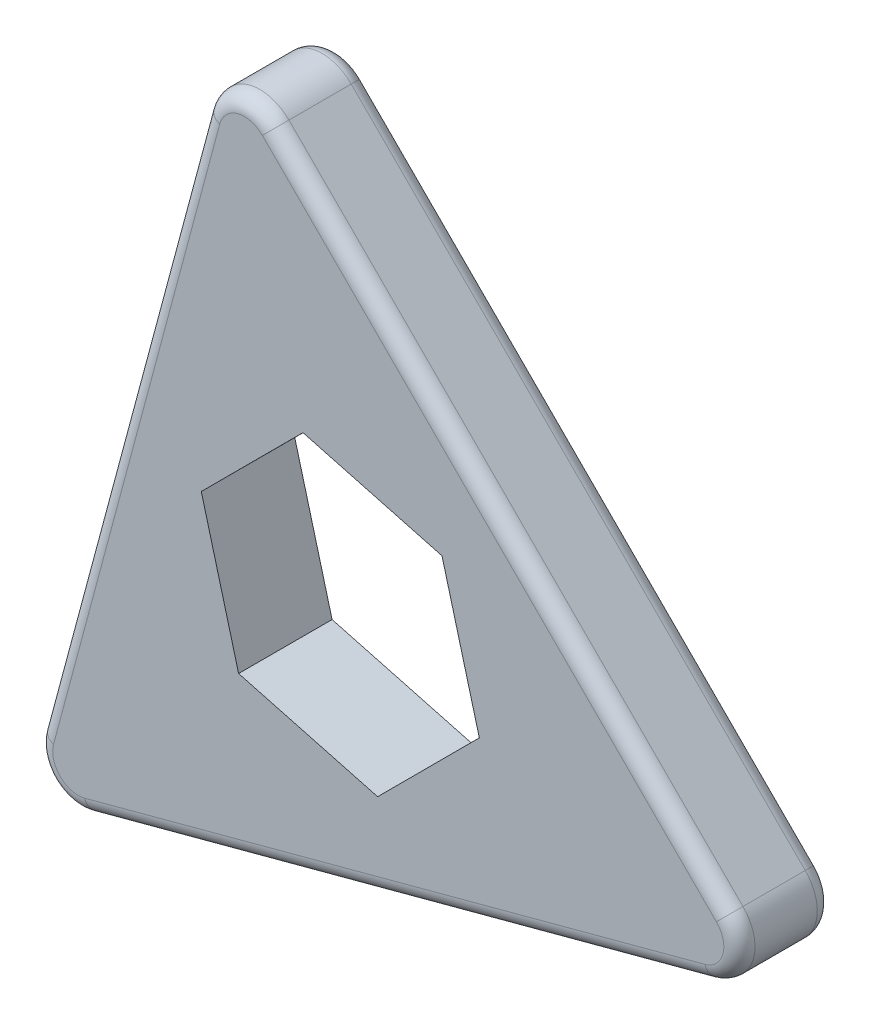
ISO-10303-21;
HEADER;
FILE_DESCRIPTION(('STEP AP214'),'2;1');
FILE_NAME('part.step','',(''),(''),'','','');
FILE_SCHEMA(('AUTOMOTIVE_DESIGN { 1 0 10303 214 1 1 1 1 }'));
ENDSEC;
DATA;
#1=APPLICATION_CONTEXT('core data for automotive mechanical design processes');
#2=APPLICATION_PROTOCOL_DEFINITION('international standard','automotive_design',2000,#1);
#3=PRODUCT_CONTEXT('',#1,'mechanical');
#4=PRODUCT('Part','Part','',(#3));
#5=PRODUCT_RELATED_PRODUCT_CATEGORY('part','',(#4));
#6=PRODUCT_DEFINITION_FORMATION('','',#4);
#7=PRODUCT_DEFINITION_CONTEXT('part definition',#1,'design');
#8=PRODUCT_DEFINITION('design','',#6,#7);
#9=PRODUCT_DEFINITION_SHAPE('','',#8);
#10=(LENGTH_UNIT() NAMED_UNIT(*) SI_UNIT(.MILLI.,.METRE.));
#11=(NAMED_UNIT(*) PLANE_ANGLE_UNIT() SI_UNIT($,.RADIAN.));
#12=(NAMED_UNIT(*) SI_UNIT($,.STERADIAN.) SOLID_ANGLE_UNIT());
#13=UNCERTAINTY_MEASURE_WITH_UNIT(LENGTH_MEASURE(1.E-05),#10,'distance_accuracy_value','');
#14=(GEOMETRIC_REPRESENTATION_CONTEXT(3) GLOBAL_UNCERTAINTY_ASSIGNED_CONTEXT((#13)) GLOBAL_UNIT_ASSIGNED_CONTEXT((#10,
#11,#12)) REPRESENTATION_CONTEXT('',''));
#15=CARTESIAN_POINT('',(0.,0.,0.));
#16=DIRECTION('',(0.,0.,1.));
#17=DIRECTION('',(1.,0.,0.));
#18=AXIS2_PLACEMENT_3D('',#15,#16,#17);
#19=CARTESIAN_POINT('',(-3.07963250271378,11.4933449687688,3.));
#20=DIRECTION('',(0.,0.,1.));
#21=DIRECTION('',(1.,0.,0.));
#22=AXIS2_PLACEMENT_3D('',#19,#20,#21);
#23=PLANE('',#22);
#24=DIRECTION('',(-0.707106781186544,0.707106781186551,0.));
#25=VECTOR('',#24,1.);
#26=CARTESIAN_POINT('',(-2.50227632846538,12.0707011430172,3.));
#27=LINE('',#26,#25);
#28=CARTESIAN_POINT('',(12.0707011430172,-2.50227632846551,3.));
#29=VERTEX_POINT('',#28);
#30=CARTESIAN_POINT('',(-2.50227632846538,12.0707011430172,3.));
#31=VERTEX_POINT('',#30);
#32=EDGE_CURVE('E232',#29,#31,#27,.T.);
#33=ORIENTED_EDGE('',*,*,#32,.T.);
#34=CARTESIAN_POINT('',(-3.07963250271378,11.4933449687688,3.));
#35=DIRECTION('',(0.,0.,1.));
#36=DIRECTION('',(1.,0.,0.));
#37=AXIS2_PLACEMENT_3D('',#34,#35,#36);
#38=CIRCLE('',#37,0.816504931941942);
#39=CARTESIAN_POINT('',(-3.8683157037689,11.7046719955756,3.));
#40=VERTEX_POINT('',#39);
#41=EDGE_CURVE('E236',#31,#40,#38,.T.);
#42=ORIENTED_EDGE('',*,*,#41,.T.);
#43=DIRECTION('',(-0.258819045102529,-0.965925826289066,0.));
#44=VECTOR('',#43,1.);
#45=CARTESIAN_POINT('',(-9.20239566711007,-8.20238543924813,3.));
#46=LINE('',#45,#44);
#47=CARTESIAN_POINT('',(-9.20239566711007,-8.20238543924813,3.));
#48=VERTEX_POINT('',#47);
#49=EDGE_CURVE('E234',#40,#48,#46,.T.);
#50=ORIENTED_EDGE('',*,*,#49,.T.);
#51=CARTESIAN_POINT('',(-8.41371246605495,-8.41371246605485,3.));
#52=DIRECTION('',(0.,0.,1.));
#53=DIRECTION('',(1.,0.,0.));
#54=AXIS2_PLACEMENT_3D('',#51,#52,#53);
#55=CIRCLE('',#54,0.816504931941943);
#56=CARTESIAN_POINT('',(-8.20238543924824,-9.20239566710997,3.));
#57=VERTEX_POINT('',#56);
#58=EDGE_CURVE('E230',#48,#57,#55,.T.);
#59=ORIENTED_EDGE('',*,*,#58,.T.);
#60=DIRECTION('',(0.965925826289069,0.258819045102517,0.));
#61=VECTOR('',#60,1.);
#62=CARTESIAN_POINT('',(11.7046719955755,-3.86831570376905,3.));
#63=LINE('',#62,#61);
#64=CARTESIAN_POINT('',(11.7046719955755,-3.86831570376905,3.));
#65=VERTEX_POINT('',#64);
#66=EDGE_CURVE('E226',#57,#65,#63,.T.);
#67=ORIENTED_EDGE('',*,*,#66,.T.);
#68=CARTESIAN_POINT('',(11.4933449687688,-3.07963250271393,3.));
#69=DIRECTION('',(0.,0.,1.));
#70=DIRECTION('',(1.,0.,0.));
#71=AXIS2_PLACEMENT_3D('',#68,#69,#70);
#72=CIRCLE('',#71,0.816504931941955);
#73=EDGE_CURVE('E228',#65,#29,#72,.T.);
#74=ORIENTED_EDGE('',*,*,#73,.T.);
#75=EDGE_LOOP('',(#33,#42,#50,#59,#67,#74));
#76=FACE_BOUND('',#75,.T.);
#77=DIRECTION('',(0.7066960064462,0.707517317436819,0.));
#78=VECTOR('',#77,1.);
#79=CARTESIAN_POINT('',(1.19802475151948,-4.46072528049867,3.));
#80=LINE('',#79,#78);
#81=CARTESIAN_POINT('',(1.19802475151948,-4.46072528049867,3.));
#82=VERTEX_POINT('',#81);
#83=CARTESIAN_POINT('',(4.46211378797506,-1.19284277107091,3.));
#84=VERTEX_POINT('',#83);
#85=EDGE_CURVE('E191',#82,#84,#80,.T.);
#86=ORIENTED_EDGE('',*,*,#85,.F.);
#87=DIRECTION('',(0.966075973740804,-0.258258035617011,0.));
#88=VECTOR('',#87,1.);
#89=CARTESIAN_POINT('',(-3.26408903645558,-3.26788250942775,3.));
#90=LINE('',#89,#88);
#91=CARTESIAN_POINT('',(-3.26408903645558,-3.26788250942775,3.));
#92=VERTEX_POINT('',#91);
#93=EDGE_CURVE('E168',#92,#82,#90,.T.);
#94=ORIENTED_EDGE('',*,*,#93,.F.);
#95=DIRECTION('',(0.259379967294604,-0.96577535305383,0.));
#96=VECTOR('',#95,1.);
#97=CARTESIAN_POINT('',(-4.46211378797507,1.19284277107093,3.));
#98=LINE('',#97,#96);
#99=CARTESIAN_POINT('',(-4.46211378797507,1.19284277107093,3.));
#100=VERTEX_POINT('',#99);
#101=EDGE_CURVE('E200',#100,#92,#98,.T.);
#102=ORIENTED_EDGE('',*,*,#101,.F.);
#103=DIRECTION('',(-0.7066960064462,-0.707517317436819,0.));
#104=VECTOR('',#103,1.);
#105=CARTESIAN_POINT('',(-1.19802475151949,4.46072528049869,3.));
#106=LINE('',#105,#104);
#107=CARTESIAN_POINT('',(-1.19802475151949,4.46072528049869,3.));
#108=VERTEX_POINT('',#107);
#109=EDGE_CURVE('E197',#108,#100,#106,.T.);
#110=ORIENTED_EDGE('',*,*,#109,.F.);
#111=DIRECTION('',(-0.966075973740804,0.258258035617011,0.));
#112=VECTOR('',#111,1.);
#113=CARTESIAN_POINT('',(3.26408903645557,3.26788250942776,3.));
#114=LINE('',#113,#112);
#115=CARTESIAN_POINT('',(3.26408903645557,3.26788250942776,3.));
#116=VERTEX_POINT('',#115);
#117=EDGE_CURVE('E195',#116,#108,#114,.T.);
#118=ORIENTED_EDGE('',*,*,#117,.F.);
#119=DIRECTION('',(-0.259379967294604,0.96577535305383,0.));
#120=VECTOR('',#119,1.);
#121=CARTESIAN_POINT('',(4.46211378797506,-1.19284277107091,3.));
#122=LINE('',#121,#120);
#123=EDGE_CURVE('E193',#84,#116,#122,.T.);
#124=ORIENTED_EDGE('',*,*,#123,.F.);
#125=EDGE_LOOP('',(#86,#94,#102,#110,#118,#124));
#126=FACE_BOUND('',#125,.T.);
#127=ADVANCED_FACE('F24',(#76,#126),#23,.T.);
#128=CARTESIAN_POINT('',(-3.07963250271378,11.4933449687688,0.));
#129=DIRECTION('',(0.,0.,1.));
#130=DIRECTION('',(1.,0.,0.));
#131=AXIS2_PLACEMENT_3D('',#128,#129,#130);
#132=PLANE('',#131);
#133=DIRECTION('',(-0.258819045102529,-0.965925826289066,0.));
#134=VECTOR('',#133,1.);
#135=CARTESIAN_POINT('',(-3.8683157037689,11.7046719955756,0.));
#136=LINE('',#135,#134);
#137=CARTESIAN_POINT('',(-9.20239566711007,-8.20238543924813,0.));
#138=VERTEX_POINT('',#137);
#139=CARTESIAN_POINT('',(-3.8683157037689,11.7046719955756,0.));
#140=VERTEX_POINT('',#139);
#141=EDGE_CURVE('E253',#138,#140,#136,.F.);
#142=ORIENTED_EDGE('',*,*,#141,.T.);
#143=CARTESIAN_POINT('',(-3.07963250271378,11.4933449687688,0.));
#144=DIRECTION('',(0.,0.,1.));
#145=DIRECTION('',(1.,0.,0.));
#146=AXIS2_PLACEMENT_3D('',#143,#144,#145);
#147=CIRCLE('',#146,0.816504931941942);
#148=CARTESIAN_POINT('',(-2.50227632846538,12.0707011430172,0.));
#149=VERTEX_POINT('',#148);
#150=EDGE_CURVE('E255',#140,#149,#147,.F.);
#151=ORIENTED_EDGE('',*,*,#150,.T.);
#152=DIRECTION('',(-0.707106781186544,0.707106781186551,0.));
#153=VECTOR('',#152,1.);
#154=CARTESIAN_POINT('',(-2.50227632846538,12.0707011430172,0.));
#155=LINE('',#154,#153);
#156=CARTESIAN_POINT('',(12.0707011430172,-2.50227632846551,0.));
#157=VERTEX_POINT('',#156);
#158=EDGE_CURVE('E251',#149,#157,#155,.F.);
#159=ORIENTED_EDGE('',*,*,#158,.T.);
#160=CARTESIAN_POINT('',(11.4933449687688,-3.07963250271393,0.));
#161=DIRECTION('',(0.,0.,1.));
#162=DIRECTION('',(1.,0.,0.));
#163=AXIS2_PLACEMENT_3D('',#160,#161,#162);
#164=CIRCLE('',#163,0.816504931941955);
#165=CARTESIAN_POINT('',(11.7046719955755,-3.86831570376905,0.));
#166=VERTEX_POINT('',#165);
#167=EDGE_CURVE('E247',#157,#166,#164,.F.);
#168=ORIENTED_EDGE('',*,*,#167,.T.);
#169=DIRECTION('',(0.965925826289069,0.258819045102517,0.));
#170=VECTOR('',#169,1.);
#171=CARTESIAN_POINT('',(1.75114327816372,-6.53535568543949,0.));
#172=LINE('',#171,#170);
#173=CARTESIAN_POINT('',(-8.20238543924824,-9.20239566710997,0.));
#174=VERTEX_POINT('',#173);
#175=EDGE_CURVE('E245',#166,#174,#172,.F.);
#176=ORIENTED_EDGE('',*,*,#175,.T.);
#177=CARTESIAN_POINT('',(-8.41371246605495,-8.41371246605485,0.));
#178=DIRECTION('',(0.,0.,1.));
#179=DIRECTION('',(1.,0.,0.));
#180=AXIS2_PLACEMENT_3D('',#177,#178,#179);
#181=CIRCLE('',#180,0.816504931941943);
#182=EDGE_CURVE('E249',#174,#138,#181,.F.);
#183=ORIENTED_EDGE('',*,*,#182,.T.);
#184=EDGE_LOOP('',(#142,#151,#159,#168,#176,#183));
#185=FACE_BOUND('',#184,.T.);
#186=DIRECTION('',(0.966075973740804,-0.258258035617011,0.));
#187=VECTOR('',#186,1.);
#188=CARTESIAN_POINT('',(-3.26408903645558,-3.26788250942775,0.));
#189=LINE('',#188,#187);
#190=CARTESIAN_POINT('',(-3.26408903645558,-3.26788250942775,0.));
#191=VERTEX_POINT('',#190);
#192=CARTESIAN_POINT('',(1.19802475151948,-4.46072528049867,0.));
#193=VERTEX_POINT('',#192);
#194=EDGE_CURVE('E161',#191,#193,#189,.T.);
#195=ORIENTED_EDGE('',*,*,#194,.T.);
#196=DIRECTION('',(0.7066960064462,0.707517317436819,0.));
#197=VECTOR('',#196,1.);
#198=CARTESIAN_POINT('',(1.19802475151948,-4.46072528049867,0.));
#199=LINE('',#198,#197);
#200=CARTESIAN_POINT('',(4.46211378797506,-1.19284277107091,0.));
#201=VERTEX_POINT('',#200);
#202=EDGE_CURVE('E149',#193,#201,#199,.T.);
#203=ORIENTED_EDGE('',*,*,#202,.T.);
#204=DIRECTION('',(-0.259379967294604,0.96577535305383,0.));
#205=VECTOR('',#204,1.);
#206=CARTESIAN_POINT('',(4.46211378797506,-1.19284277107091,0.));
#207=LINE('',#206,#205);
#208=CARTESIAN_POINT('',(3.26408903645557,3.26788250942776,0.));
#209=VERTEX_POINT('',#208);
#210=EDGE_CURVE('E160',#201,#209,#207,.T.);
#211=ORIENTED_EDGE('',*,*,#210,.T.);
#212=DIRECTION('',(-0.966075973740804,0.258258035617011,0.));
#213=VECTOR('',#212,1.);
#214=CARTESIAN_POINT('',(3.26408903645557,3.26788250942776,0.));
#215=LINE('',#214,#213);
#216=CARTESIAN_POINT('',(-1.19802475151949,4.46072528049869,0.));
#217=VERTEX_POINT('',#216);
#218=EDGE_CURVE('E184',#209,#217,#215,.T.);
#219=ORIENTED_EDGE('',*,*,#218,.T.);
#220=DIRECTION('',(-0.7066960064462,-0.707517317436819,0.));
#221=VECTOR('',#220,1.);
#222=CARTESIAN_POINT('',(-1.19802475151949,4.46072528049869,0.));
#223=LINE('',#222,#221);
#224=CARTESIAN_POINT('',(-4.46211378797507,1.19284277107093,0.));
#225=VERTEX_POINT('',#224);
#226=EDGE_CURVE('E187',#217,#225,#223,.T.);
#227=ORIENTED_EDGE('',*,*,#226,.T.);
#228=DIRECTION('',(0.259379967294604,-0.96577535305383,0.));
#229=VECTOR('',#228,1.);
#230=CARTESIAN_POINT('',(-4.46211378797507,1.19284277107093,0.));
#231=LINE('',#230,#229);
#232=EDGE_CURVE('E175',#225,#191,#231,.T.);
#233=ORIENTED_EDGE('',*,*,#232,.T.);
#234=EDGE_LOOP('',(#195,#203,#211,#219,#227,#233));
#235=FACE_BOUND('',#234,.T.);
#236=ADVANCED_FACE('F172',(#185,#235),#132,.F.);
#237=CARTESIAN_POINT('',(-3.07963250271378,11.4933449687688,3.));
#238=DIRECTION('',(0.,0.,-1.));
#239=DIRECTION('',(-1.,0.,0.));
#240=AXIS2_PLACEMENT_3D('',#237,#238,#239);
#241=CYLINDRICAL_SURFACE('',#240,1.31650493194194);
#242=DIRECTION('',(0.,0.,-1.));
#243=VECTOR('',#242,1.);
#244=CARTESIAN_POINT('',(-4.35127861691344,11.8340815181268,3.));
#245=LINE('',#244,#243);
#246=CARTESIAN_POINT('',(-4.35127861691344,11.8340815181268,2.5));
#247=VERTEX_POINT('',#246);
#248=CARTESIAN_POINT('',(-4.35127861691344,11.8340815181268,0.5));
#249=VERTEX_POINT('',#248);
#250=EDGE_CURVE('E223',#247,#249,#245,.T.);
#251=ORIENTED_EDGE('',*,*,#250,.F.);
#252=CARTESIAN_POINT('',(-3.07963250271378,11.4933449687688,2.5));
#253=DIRECTION('',(0.,0.,1.));
#254=DIRECTION('',(1.,0.,0.));
#255=AXIS2_PLACEMENT_3D('',#252,#253,#254);
#256=CIRCLE('',#255,1.31650493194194);
#257=CARTESIAN_POINT('',(-2.1487229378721,12.4242545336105,2.5));
#258=VERTEX_POINT('',#257);
#259=EDGE_CURVE('E242',#247,#258,#256,.F.);
#260=ORIENTED_EDGE('',*,*,#259,.T.);
#261=DIRECTION('',(0.,0.,-1.));
#262=VECTOR('',#261,1.);
#263=CARTESIAN_POINT('',(-2.1487229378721,12.4242545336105,3.));
#264=LINE('',#263,#262);
#265=CARTESIAN_POINT('',(-2.1487229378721,12.4242545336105,0.5));
#266=VERTEX_POINT('',#265);
#267=EDGE_CURVE('E169',#258,#266,#264,.T.);
#268=ORIENTED_EDGE('',*,*,#267,.T.);
#269=CARTESIAN_POINT('',(-3.07963250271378,11.4933449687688,0.5));
#270=DIRECTION('',(0.,0.,1.));
#271=DIRECTION('',(1.,0.,0.));
#272=AXIS2_PLACEMENT_3D('',#269,#270,#271);
#273=CIRCLE('',#272,1.31650493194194);
#274=EDGE_CURVE('E239',#266,#249,#273,.T.);
#275=ORIENTED_EDGE('',*,*,#274,.T.);
#276=EDGE_LOOP('',(#251,#260,#268,#275));
#277=FACE_BOUND('',#276,.T.);
#278=ADVANCED_FACE('F26',(#277),#241,.T.);
#279=CARTESIAN_POINT('',(-4.35127861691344,11.8340815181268,3.));
#280=DIRECTION('',(0.965925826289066,-0.258819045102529,0.));
#281=DIRECTION('',(0.258819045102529,0.965925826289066,0.));
#282=AXIS2_PLACEMENT_3D('',#279,#280,#281);
#283=PLANE('',#282);
#284=DIRECTION('',(0.,0.,-1.));
#285=VECTOR('',#284,1.);
#286=CARTESIAN_POINT('',(-9.6853585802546,-8.07297591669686,3.));
#287=LINE('',#286,#285);
#288=CARTESIAN_POINT('',(-9.6853585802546,-8.07297591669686,2.5));
#289=VERTEX_POINT('',#288);
#290=CARTESIAN_POINT('',(-9.6853585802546,-8.07297591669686,0.5));
#291=VERTEX_POINT('',#290);
#292=EDGE_CURVE('E220',#289,#291,#287,.T.);
#293=ORIENTED_EDGE('',*,*,#292,.F.);
#294=DIRECTION('',(-0.258819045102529,-0.965925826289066,0.));
#295=VECTOR('',#294,1.);
#296=CARTESIAN_POINT('',(-4.35127861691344,11.8340815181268,2.5));
#297=LINE('',#296,#295);
#298=EDGE_CURVE('E260',#289,#247,#297,.F.);
#299=ORIENTED_EDGE('',*,*,#298,.T.);
#300=ORIENTED_EDGE('',*,*,#250,.T.);
#301=DIRECTION('',(-0.258819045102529,-0.965925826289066,0.));
#302=VECTOR('',#301,1.);
#303=CARTESIAN_POINT('',(-4.35127861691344,11.8340815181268,0.5));
#304=LINE('',#303,#302);
#305=EDGE_CURVE('E258',#249,#291,#304,.T.);
#306=ORIENTED_EDGE('',*,*,#305,.T.);
#307=EDGE_LOOP('',(#293,#299,#300,#306));
#308=FACE_BOUND('',#307,.T.);
#309=ADVANCED_FACE('F308',(#308),#283,.F.);
#310=CARTESIAN_POINT('',(-8.41371246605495,-8.41371246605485,3.));
#311=DIRECTION('',(0.,0.,-1.));
#312=DIRECTION('',(-1.,0.,0.));
#313=AXIS2_PLACEMENT_3D('',#310,#311,#312);
#314=CYLINDRICAL_SURFACE('',#313,1.31650493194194);
#315=DIRECTION('',(0.,0.,-1.));
#316=VECTOR('',#315,1.);
#317=CARTESIAN_POINT('',(-8.07297591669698,-9.6853585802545,3.));
#318=LINE('',#317,#316);
#319=CARTESIAN_POINT('',(-8.07297591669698,-9.6853585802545,2.5));
#320=VERTEX_POINT('',#319);
#321=CARTESIAN_POINT('',(-8.07297591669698,-9.6853585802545,0.5));
#322=VERTEX_POINT('',#321);
#323=EDGE_CURVE('E218',#320,#322,#318,.T.);
#324=ORIENTED_EDGE('',*,*,#323,.F.);
#325=CARTESIAN_POINT('',(-8.41371246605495,-8.41371246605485,2.5));
#326=DIRECTION('',(0.,0.,1.));
#327=DIRECTION('',(1.,0.,0.));
#328=AXIS2_PLACEMENT_3D('',#325,#326,#327);
#329=CIRCLE('',#328,1.31650493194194);
#330=EDGE_CURVE('E268',#320,#289,#329,.F.);
#331=ORIENTED_EDGE('',*,*,#330,.T.);
#332=ORIENTED_EDGE('',*,*,#292,.T.);
#333=CARTESIAN_POINT('',(-8.41371246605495,-8.41371246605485,0.5));
#334=DIRECTION('',(0.,0.,1.));
#335=DIRECTION('',(1.,0.,0.));
#336=AXIS2_PLACEMENT_3D('',#333,#334,#335);
#337=CIRCLE('',#336,1.31650493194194);
#338=EDGE_CURVE('E266',#291,#322,#337,.T.);
#339=ORIENTED_EDGE('',*,*,#338,.T.);
#340=EDGE_LOOP('',(#324,#331,#332,#339));
#341=FACE_BOUND('',#340,.T.);
#342=ADVANCED_FACE('F377',(#341),#314,.T.);
#343=CARTESIAN_POINT('',(-8.07297591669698,-9.6853585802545,3.));
#344=DIRECTION('',(-0.258819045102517,0.965925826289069,0.));
#345=DIRECTION('',(-0.965925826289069,-0.258819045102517,0.));
#346=AXIS2_PLACEMENT_3D('',#343,#344,#345);
#347=PLANE('',#346);
#348=DIRECTION('',(0.,0.,-1.));
#349=VECTOR('',#348,1.);
#350=CARTESIAN_POINT('',(11.8340815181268,-4.3512786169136,3.));
#351=LINE('',#350,#349);
#352=CARTESIAN_POINT('',(11.8340815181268,-4.3512786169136,2.5));
#353=VERTEX_POINT('',#352);
#354=CARTESIAN_POINT('',(11.8340815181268,-4.3512786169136,0.5));
#355=VERTEX_POINT('',#354);
#356=EDGE_CURVE('E216',#353,#355,#351,.T.);
#357=ORIENTED_EDGE('',*,*,#356,.F.);
#358=DIRECTION('',(0.965925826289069,0.258819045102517,0.));
#359=VECTOR('',#358,1.);
#360=CARTESIAN_POINT('',(-8.07297591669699,-9.6853585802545,2.5));
#361=LINE('',#360,#359);
#362=EDGE_CURVE('E11',#353,#320,#361,.F.);
#363=ORIENTED_EDGE('',*,*,#362,.T.);
#364=ORIENTED_EDGE('',*,*,#323,.T.);
#365=DIRECTION('',(0.965925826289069,0.258819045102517,0.));
#366=VECTOR('',#365,1.);
#367=CARTESIAN_POINT('',(-8.07297591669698,-9.6853585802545,0.5));
#368=LINE('',#367,#366);
#369=EDGE_CURVE('E32',#322,#355,#368,.T.);
#370=ORIENTED_EDGE('',*,*,#369,.T.);
#371=EDGE_LOOP('',(#357,#363,#364,#370));
#372=FACE_BOUND('',#371,.T.);
#373=ADVANCED_FACE('F374',(#372),#347,.F.);
#374=CARTESIAN_POINT('',(11.4933449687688,-3.07963250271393,3.));
#375=DIRECTION('',(0.,0.,-1.));
#376=DIRECTION('',(-1.,0.,0.));
#377=AXIS2_PLACEMENT_3D('',#374,#375,#376);
#378=CYLINDRICAL_SURFACE('',#377,1.31650493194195);
#379=DIRECTION('',(0.,0.,-1.));
#380=VECTOR('',#379,1.);
#381=CARTESIAN_POINT('',(12.4242545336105,-2.14872293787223,3.));
#382=LINE('',#381,#380);
#383=CARTESIAN_POINT('',(12.4242545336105,-2.14872293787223,2.5));
#384=VERTEX_POINT('',#383);
#385=CARTESIAN_POINT('',(12.4242545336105,-2.14872293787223,0.5));
#386=VERTEX_POINT('',#385);
#387=EDGE_CURVE('E213',#384,#386,#382,.T.);
#388=ORIENTED_EDGE('',*,*,#387,.F.);
#389=CARTESIAN_POINT('',(11.4933449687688,-3.07963250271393,2.5));
#390=DIRECTION('',(0.,0.,1.));
#391=DIRECTION('',(1.,0.,0.));
#392=AXIS2_PLACEMENT_3D('',#389,#390,#391);
#393=CIRCLE('',#392,1.31650493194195);
#394=EDGE_CURVE('E45',#384,#353,#393,.F.);
#395=ORIENTED_EDGE('',*,*,#394,.T.);
#396=ORIENTED_EDGE('',*,*,#356,.T.);
#397=CARTESIAN_POINT('',(11.4933449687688,-3.07963250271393,0.5));
#398=DIRECTION('',(0.,0.,1.));
#399=DIRECTION('',(1.,0.,0.));
#400=AXIS2_PLACEMENT_3D('',#397,#398,#399);
#401=CIRCLE('',#400,1.31650493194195);
#402=EDGE_CURVE('E270',#355,#386,#401,.T.);
#403=ORIENTED_EDGE('',*,*,#402,.T.);
#404=EDGE_LOOP('',(#388,#395,#396,#403));
#405=FACE_BOUND('',#404,.T.);
#406=ADVANCED_FACE('F273',(#405),#378,.T.);
#407=CARTESIAN_POINT('',(-2.1487229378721,12.4242545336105,3.));
#408=DIRECTION('',(-0.707106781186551,-0.707106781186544,0.));
#409=DIRECTION('',(0.707106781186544,-0.707106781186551,0.));
#410=AXIS2_PLACEMENT_3D('',#407,#408,#409);
#411=PLANE('',#410);
#412=ORIENTED_EDGE('',*,*,#267,.F.);
#413=DIRECTION('',(-0.707106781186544,0.707106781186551,0.));
#414=VECTOR('',#413,1.);
#415=CARTESIAN_POINT('',(12.4242545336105,-2.14872293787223,2.5));
#416=LINE('',#415,#414);
#417=EDGE_CURVE('E264',#258,#384,#416,.F.);
#418=ORIENTED_EDGE('',*,*,#417,.T.);
#419=ORIENTED_EDGE('',*,*,#387,.T.);
#420=DIRECTION('',(-0.707106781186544,0.707106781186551,0.));
#421=VECTOR('',#420,1.);
#422=CARTESIAN_POINT('',(-2.1487229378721,12.4242545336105,0.5));
#423=LINE('',#422,#421);
#424=EDGE_CURVE('E262',#386,#266,#423,.T.);
#425=ORIENTED_EDGE('',*,*,#424,.T.);
#426=EDGE_LOOP('',(#412,#418,#419,#425));
#427=FACE_BOUND('',#426,.T.);
#428=ADVANCED_FACE('F280',(#427),#411,.F.);
#429=CARTESIAN_POINT('',(-3.26408903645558,-3.26788250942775,3.));
#430=DIRECTION('',(0.258258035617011,0.966075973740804,0.));
#431=DIRECTION('',(-0.966075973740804,0.258258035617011,0.));
#432=AXIS2_PLACEMENT_3D('',#429,#430,#431);
#433=PLANE('',#432);
#434=ORIENTED_EDGE('',*,*,#194,.F.);
#435=DIRECTION('',(0.,0.,-1.));
#436=VECTOR('',#435,1.);
#437=CARTESIAN_POINT('',(-3.26408903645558,-3.26788250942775,3.));
#438=LINE('',#437,#436);
#439=EDGE_CURVE('E202',#92,#191,#438,.T.);
#440=ORIENTED_EDGE('',*,*,#439,.F.);
#441=ORIENTED_EDGE('',*,*,#93,.T.);
#442=DIRECTION('',(0.,0.,-1.));
#443=VECTOR('',#442,1.);
#444=CARTESIAN_POINT('',(1.19802475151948,-4.46072528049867,3.));
#445=LINE('',#444,#443);
#446=EDGE_CURVE('E152',#82,#193,#445,.T.);
#447=ORIENTED_EDGE('',*,*,#446,.T.);
#448=EDGE_LOOP('',(#434,#440,#441,#447));
#449=FACE_BOUND('',#448,.T.);
#450=ADVANCED_FACE('F164',(#449),#433,.T.);
#451=CARTESIAN_POINT('',(1.19802475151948,-4.46072528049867,3.));
#452=DIRECTION('',(-0.707517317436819,0.7066960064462,0.));
#453=DIRECTION('',(-0.7066960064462,-0.707517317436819,0.));
#454=AXIS2_PLACEMENT_3D('',#451,#452,#453);
#455=PLANE('',#454);
#456=ORIENTED_EDGE('',*,*,#202,.F.);
#457=ORIENTED_EDGE('',*,*,#446,.F.);
#458=ORIENTED_EDGE('',*,*,#85,.T.);
#459=DIRECTION('',(0.,0.,-1.));
#460=VECTOR('',#459,1.);
#461=CARTESIAN_POINT('',(4.46211378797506,-1.19284277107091,3.));
#462=LINE('',#461,#460);
#463=EDGE_CURVE('E155',#84,#201,#462,.T.);
#464=ORIENTED_EDGE('',*,*,#463,.T.);
#465=EDGE_LOOP('',(#456,#457,#458,#464));
#466=FACE_BOUND('',#465,.T.);
#467=ADVANCED_FACE('F151',(#466),#455,.T.);
#468=CARTESIAN_POINT('',(4.46211378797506,-1.19284277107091,3.));
#469=DIRECTION('',(-0.96577535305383,-0.259379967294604,0.));
#470=DIRECTION('',(0.259379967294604,-0.96577535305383,0.));
#471=AXIS2_PLACEMENT_3D('',#468,#469,#470);
#472=PLANE('',#471);
#473=ORIENTED_EDGE('',*,*,#210,.F.);
#474=ORIENTED_EDGE('',*,*,#463,.F.);
#475=ORIENTED_EDGE('',*,*,#123,.T.);
#476=DIRECTION('',(0.,0.,-1.));
#477=VECTOR('',#476,1.);
#478=CARTESIAN_POINT('',(3.26408903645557,3.26788250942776,3.));
#479=LINE('',#478,#477);
#480=EDGE_CURVE('E208',#116,#209,#479,.T.);
#481=ORIENTED_EDGE('',*,*,#480,.T.);
#482=EDGE_LOOP('',(#473,#474,#475,#481));
#483=FACE_BOUND('',#482,.T.);
#484=ADVANCED_FACE('F422',(#483),#472,.T.);
#485=CARTESIAN_POINT('',(3.26408903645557,3.26788250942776,3.));
#486=DIRECTION('',(-0.258258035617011,-0.966075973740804,0.));
#487=DIRECTION('',(0.966075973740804,-0.258258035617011,0.));
#488=AXIS2_PLACEMENT_3D('',#485,#486,#487);
#489=PLANE('',#488);
#490=ORIENTED_EDGE('',*,*,#218,.F.);
#491=ORIENTED_EDGE('',*,*,#480,.F.);
#492=ORIENTED_EDGE('',*,*,#117,.T.);
#493=DIRECTION('',(0.,0.,-1.));
#494=VECTOR('',#493,1.);
#495=CARTESIAN_POINT('',(-1.19802475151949,4.46072528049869,3.));
#496=LINE('',#495,#494);
#497=EDGE_CURVE('E206',#108,#217,#496,.T.);
#498=ORIENTED_EDGE('',*,*,#497,.T.);
#499=EDGE_LOOP('',(#490,#491,#492,#498));
#500=FACE_BOUND('',#499,.T.);
#501=ADVANCED_FACE('F429',(#500),#489,.T.);
#502=CARTESIAN_POINT('',(-1.19802475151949,4.46072528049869,3.));
#503=DIRECTION('',(0.707517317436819,-0.7066960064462,0.));
#504=DIRECTION('',(0.7066960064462,0.707517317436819,0.));
#505=AXIS2_PLACEMENT_3D('',#502,#503,#504);
#506=PLANE('',#505);
#507=ORIENTED_EDGE('',*,*,#226,.F.);
#508=ORIENTED_EDGE('',*,*,#497,.F.);
#509=ORIENTED_EDGE('',*,*,#109,.T.);
#510=DIRECTION('',(0.,0.,-1.));
#511=VECTOR('',#510,1.);
#512=CARTESIAN_POINT('',(-4.46211378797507,1.19284277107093,3.));
#513=LINE('',#512,#511);
#514=EDGE_CURVE('E204',#100,#225,#513,.T.);
#515=ORIENTED_EDGE('',*,*,#514,.T.);
#516=EDGE_LOOP('',(#507,#508,#509,#515));
#517=FACE_BOUND('',#516,.T.);
#518=ADVANCED_FACE('F437',(#517),#506,.T.);
#519=CARTESIAN_POINT('',(-4.46211378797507,1.19284277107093,3.));
#520=DIRECTION('',(0.96577535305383,0.259379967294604,0.));
#521=DIRECTION('',(-0.259379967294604,0.96577535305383,0.));
#522=AXIS2_PLACEMENT_3D('',#519,#520,#521);
#523=PLANE('',#522);
#524=ORIENTED_EDGE('',*,*,#232,.F.);
#525=ORIENTED_EDGE('',*,*,#514,.F.);
#526=ORIENTED_EDGE('',*,*,#101,.T.);
#527=ORIENTED_EDGE('',*,*,#439,.T.);
#528=EDGE_LOOP('',(#524,#525,#526,#527));
#529=FACE_BOUND('',#528,.T.);
#530=ADVANCED_FACE('F359',(#529),#523,.T.);
#531=CARTESIAN_POINT('',(1.75114327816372,-6.53535568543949,2.5));
#532=DIRECTION('',(-0.965925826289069,-0.258819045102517,0.));
#533=DIRECTION('',(0.258819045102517,-0.965925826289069,0.));
#534=AXIS2_PLACEMENT_3D('',#531,#532,#533);
#535=CYLINDRICAL_SURFACE('',#534,0.5);
#536=CARTESIAN_POINT('',(-8.20238543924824,-9.20239566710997,2.5));
#537=DIRECTION('',(-0.96592582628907,-0.258819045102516,0.));
#538=DIRECTION('',(0.258819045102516,-0.96592582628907,0.));
#539=AXIS2_PLACEMENT_3D('',#536,#537,#538);
#540=CIRCLE('',#539,0.5);
#541=EDGE_CURVE('E179',#320,#57,#540,.T.);
#542=ORIENTED_EDGE('',*,*,#541,.F.);
#543=ORIENTED_EDGE('',*,*,#362,.F.);
#544=CARTESIAN_POINT('',(11.7046719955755,-3.86831570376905,2.5));
#545=DIRECTION('',(0.965925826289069,0.258819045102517,0.));
#546=DIRECTION('',(-0.258819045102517,0.965925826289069,0.));
#547=AXIS2_PLACEMENT_3D('',#544,#545,#546);
#548=CIRCLE('',#547,0.5);
#549=EDGE_CURVE('E176',#65,#353,#548,.T.);
#550=ORIENTED_EDGE('',*,*,#549,.F.);
#551=ORIENTED_EDGE('',*,*,#66,.F.);
#552=EDGE_LOOP('',(#542,#543,#550,#551));
#553=FACE_BOUND('',#552,.T.);
#554=ADVANCED_FACE('F339',(#553),#535,.T.);
#555=CARTESIAN_POINT('',(11.4933449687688,-3.07963250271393,2.5));
#556=DIRECTION('',(0.,0.,1.));
#557=DIRECTION('',(1.,0.,0.));
#558=AXIS2_PLACEMENT_3D('',#555,#556,#557);
#559=TOROIDAL_SURFACE('',#558,0.816504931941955,0.5);
#560=ORIENTED_EDGE('',*,*,#549,.T.);
#561=ORIENTED_EDGE('',*,*,#394,.F.);
#562=CARTESIAN_POINT('',(12.0707011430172,-2.50227632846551,2.5));
#563=DIRECTION('',(-0.707106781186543,0.707106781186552,0.));
#564=DIRECTION('',(-0.707106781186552,-0.707106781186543,0.));
#565=AXIS2_PLACEMENT_3D('',#562,#563,#564);
#566=CIRCLE('',#565,0.5);
#567=EDGE_CURVE('E328',#29,#384,#566,.T.);
#568=ORIENTED_EDGE('',*,*,#567,.F.);
#569=ORIENTED_EDGE('',*,*,#73,.F.);
#570=EDGE_LOOP('',(#560,#561,#568,#569));
#571=FACE_BOUND('',#570,.T.);
#572=ADVANCED_FACE('F351',(#571),#559,.T.);
#573=CARTESIAN_POINT('',(-8.41371246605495,-8.41371246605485,2.5));
#574=DIRECTION('',(0.,0.,1.));
#575=DIRECTION('',(1.,0.,0.));
#576=AXIS2_PLACEMENT_3D('',#573,#574,#575);
#577=TOROIDAL_SURFACE('',#576,0.816504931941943,0.5);
#578=ORIENTED_EDGE('',*,*,#541,.T.);
#579=ORIENTED_EDGE('',*,*,#58,.F.);
#580=CARTESIAN_POINT('',(-9.20239566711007,-8.20238543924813,2.5));
#581=DIRECTION('',(0.258819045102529,0.965925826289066,0.));
#582=DIRECTION('',(-0.965925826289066,0.258819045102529,0.));
#583=AXIS2_PLACEMENT_3D('',#580,#581,#582);
#584=CIRCLE('',#583,0.5);
#585=EDGE_CURVE('E316',#289,#48,#584,.T.);
#586=ORIENTED_EDGE('',*,*,#585,.F.);
#587=ORIENTED_EDGE('',*,*,#330,.F.);
#588=EDGE_LOOP('',(#578,#579,#586,#587));
#589=FACE_BOUND('',#588,.T.);
#590=ADVANCED_FACE('F335',(#589),#577,.T.);
#591=CARTESIAN_POINT('',(-2.50227632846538,12.0707011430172,2.5));
#592=DIRECTION('',(0.707106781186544,-0.707106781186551,0.));
#593=DIRECTION('',(0.707106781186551,0.707106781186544,0.));
#594=AXIS2_PLACEMENT_3D('',#591,#592,#593);
#595=CYLINDRICAL_SURFACE('',#594,0.5);
#596=ORIENTED_EDGE('',*,*,#567,.T.);
#597=ORIENTED_EDGE('',*,*,#417,.F.);
#598=CARTESIAN_POINT('',(-2.50227632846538,12.0707011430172,2.5));
#599=DIRECTION('',(-0.707106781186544,0.70710678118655,0.));
#600=DIRECTION('',(-0.707106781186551,-0.707106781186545,0.));
#601=AXIS2_PLACEMENT_3D('',#598,#599,#600);
#602=CIRCLE('',#601,0.5);
#603=EDGE_CURVE('E320',#31,#258,#602,.T.);
#604=ORIENTED_EDGE('',*,*,#603,.F.);
#605=ORIENTED_EDGE('',*,*,#32,.F.);
#606=EDGE_LOOP('',(#596,#597,#604,#605));
#607=FACE_BOUND('',#606,.T.);
#608=ADVANCED_FACE('F349',(#607),#595,.T.);
#609=CARTESIAN_POINT('',(-3.8683157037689,11.7046719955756,2.5));
#610=DIRECTION('',(0.258819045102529,0.965925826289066,0.));
#611=DIRECTION('',(-0.965925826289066,0.258819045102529,0.));
#612=AXIS2_PLACEMENT_3D('',#609,#610,#611);
#613=CYLINDRICAL_SURFACE('',#612,0.5);
#614=ORIENTED_EDGE('',*,*,#585,.T.);
#615=ORIENTED_EDGE('',*,*,#49,.F.);
#616=CARTESIAN_POINT('',(-3.8683157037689,11.7046719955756,2.5));
#617=DIRECTION('',(0.25881904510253,0.965925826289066,0.));
#618=DIRECTION('',(-0.965925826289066,0.25881904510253,0.));
#619=AXIS2_PLACEMENT_3D('',#616,#617,#618);
#620=CIRCLE('',#619,0.5);
#621=EDGE_CURVE('E317',#247,#40,#620,.T.);
#622=ORIENTED_EDGE('',*,*,#621,.F.);
#623=ORIENTED_EDGE('',*,*,#298,.F.);
#624=EDGE_LOOP('',(#614,#615,#622,#623));
#625=FACE_BOUND('',#624,.T.);
#626=ADVANCED_FACE('F314',(#625),#613,.T.);
#627=CARTESIAN_POINT('',(-3.07963250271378,11.4933449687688,2.5));
#628=DIRECTION('',(0.,0.,1.));
#629=DIRECTION('',(1.,0.,0.));
#630=AXIS2_PLACEMENT_3D('',#627,#628,#629);
#631=TOROIDAL_SURFACE('',#630,0.816504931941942,0.5);
#632=ORIENTED_EDGE('',*,*,#603,.T.);
#633=ORIENTED_EDGE('',*,*,#259,.F.);
#634=ORIENTED_EDGE('',*,*,#621,.T.);
#635=ORIENTED_EDGE('',*,*,#41,.F.);
#636=EDGE_LOOP('',(#632,#633,#634,#635));
#637=FACE_BOUND('',#636,.T.);
#638=ADVANCED_FACE('F347',(#637),#631,.T.);
#639=CARTESIAN_POINT('',(-8.20238543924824,-9.20239566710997,0.5));
#640=DIRECTION('',(0.965925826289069,0.258819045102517,0.));
#641=DIRECTION('',(-0.258819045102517,0.965925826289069,0.));
#642=AXIS2_PLACEMENT_3D('',#639,#640,#641);
#643=CYLINDRICAL_SURFACE('',#642,0.5);
#644=CARTESIAN_POINT('',(-8.20238543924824,-9.20239566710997,0.5));
#645=DIRECTION('',(-0.96592582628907,-0.258819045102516,0.));
#646=DIRECTION('',(0.258819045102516,-0.96592582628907,0.));
#647=AXIS2_PLACEMENT_3D('',#644,#645,#646);
#648=CIRCLE('',#647,0.5);
#649=EDGE_CURVE('E289',#174,#322,#648,.T.);
#650=ORIENTED_EDGE('',*,*,#649,.F.);
#651=ORIENTED_EDGE('',*,*,#175,.F.);
#652=CARTESIAN_POINT('',(11.7046719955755,-3.86831570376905,0.5));
#653=DIRECTION('',(0.96592582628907,0.258819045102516,0.));
#654=DIRECTION('',(-0.258819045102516,0.96592582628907,0.));
#655=AXIS2_PLACEMENT_3D('',#652,#653,#654);
#656=CIRCLE('',#655,0.5);
#657=EDGE_CURVE('E321',#355,#166,#656,.T.);
#658=ORIENTED_EDGE('',*,*,#657,.F.);
#659=ORIENTED_EDGE('',*,*,#369,.F.);
#660=EDGE_LOOP('',(#650,#651,#658,#659));
#661=FACE_BOUND('',#660,.T.);
#662=ADVANCED_FACE('F481',(#661),#643,.T.);
#663=CARTESIAN_POINT('',(11.4933449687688,-3.07963250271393,0.5));
#664=DIRECTION('',(0.,0.,1.));
#665=DIRECTION('',(1.,0.,0.));
#666=AXIS2_PLACEMENT_3D('',#663,#664,#665);
#667=TOROIDAL_SURFACE('',#666,0.816504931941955,0.5);
#668=ORIENTED_EDGE('',*,*,#657,.T.);
#669=ORIENTED_EDGE('',*,*,#167,.F.);
#670=CARTESIAN_POINT('',(12.0707011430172,-2.50227632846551,0.5));
#671=DIRECTION('',(-0.707106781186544,0.707106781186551,0.));
#672=DIRECTION('',(-0.707106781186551,-0.707106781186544,0.));
#673=AXIS2_PLACEMENT_3D('',#670,#671,#672);
#674=CIRCLE('',#673,0.5);
#675=EDGE_CURVE('E285',#386,#157,#674,.T.);
#676=ORIENTED_EDGE('',*,*,#675,.F.);
#677=ORIENTED_EDGE('',*,*,#402,.F.);
#678=EDGE_LOOP('',(#668,#669,#676,#677));
#679=FACE_BOUND('',#678,.T.);
#680=ADVANCED_FACE('F286',(#679),#667,.T.);
#681=CARTESIAN_POINT('',(-8.41371246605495,-8.41371246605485,0.5));
#682=DIRECTION('',(0.,0.,1.));
#683=DIRECTION('',(1.,0.,0.));
#684=AXIS2_PLACEMENT_3D('',#681,#682,#683);
#685=TOROIDAL_SURFACE('',#684,0.816504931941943,0.5);
#686=ORIENTED_EDGE('',*,*,#649,.T.);
#687=ORIENTED_EDGE('',*,*,#338,.F.);
#688=CARTESIAN_POINT('',(-9.20239566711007,-8.20238543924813,0.5));
#689=DIRECTION('',(0.258819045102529,0.965925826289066,0.));
#690=DIRECTION('',(-0.965925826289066,0.258819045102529,0.));
#691=AXIS2_PLACEMENT_3D('',#688,#689,#690);
#692=CIRCLE('',#691,0.5);
#693=EDGE_CURVE('E290',#138,#291,#692,.T.);
#694=ORIENTED_EDGE('',*,*,#693,.F.);
#695=ORIENTED_EDGE('',*,*,#182,.F.);
#696=EDGE_LOOP('',(#686,#687,#694,#695));
#697=FACE_BOUND('',#696,.T.);
#698=ADVANCED_FACE('F495',(#697),#685,.T.);
#699=CARTESIAN_POINT('',(-2.50227632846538,12.0707011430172,0.5));
#700=DIRECTION('',(-0.707106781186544,0.707106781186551,0.));
#701=DIRECTION('',(-0.707106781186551,-0.707106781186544,0.));
#702=AXIS2_PLACEMENT_3D('',#699,#700,#701);
#703=CYLINDRICAL_SURFACE('',#702,0.5);
#704=ORIENTED_EDGE('',*,*,#675,.T.);
#705=ORIENTED_EDGE('',*,*,#158,.F.);
#706=CARTESIAN_POINT('',(-2.50227632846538,12.0707011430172,0.5));
#707=DIRECTION('',(-0.707106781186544,0.70710678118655,0.));
#708=DIRECTION('',(-0.707106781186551,-0.707106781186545,0.));
#709=AXIS2_PLACEMENT_3D('',#706,#707,#708);
#710=CIRCLE('',#709,0.5);
#711=EDGE_CURVE('E294',#266,#149,#710,.T.);
#712=ORIENTED_EDGE('',*,*,#711,.F.);
#713=ORIENTED_EDGE('',*,*,#424,.F.);
#714=EDGE_LOOP('',(#704,#705,#712,#713));
#715=FACE_BOUND('',#714,.T.);
#716=ADVANCED_FACE('F293',(#715),#703,.T.);
#717=CARTESIAN_POINT('',(-3.8683157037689,11.7046719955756,0.5));
#718=DIRECTION('',(-0.258819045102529,-0.965925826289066,0.));
#719=DIRECTION('',(0.965925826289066,-0.258819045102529,0.));
#720=AXIS2_PLACEMENT_3D('',#717,#718,#719);
#721=CYLINDRICAL_SURFACE('',#720,0.5);
#722=ORIENTED_EDGE('',*,*,#693,.T.);
#723=ORIENTED_EDGE('',*,*,#305,.F.);
#724=CARTESIAN_POINT('',(-3.8683157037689,11.7046719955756,0.5));
#725=DIRECTION('',(0.25881904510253,0.965925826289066,0.));
#726=DIRECTION('',(-0.965925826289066,0.25881904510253,0.));
#727=AXIS2_PLACEMENT_3D('',#724,#725,#726);
#728=CIRCLE('',#727,0.5);
#729=EDGE_CURVE('E298',#140,#249,#728,.T.);
#730=ORIENTED_EDGE('',*,*,#729,.F.);
#731=ORIENTED_EDGE('',*,*,#141,.F.);
#732=EDGE_LOOP('',(#722,#723,#730,#731));
#733=FACE_BOUND('',#732,.T.);
#734=ADVANCED_FACE('F509',(#733),#721,.T.);
#735=CARTESIAN_POINT('',(-3.07963250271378,11.4933449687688,0.5));
#736=DIRECTION('',(0.,0.,1.));
#737=DIRECTION('',(1.,0.,0.));
#738=AXIS2_PLACEMENT_3D('',#735,#736,#737);
#739=TOROIDAL_SURFACE('',#738,0.816504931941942,0.5);
#740=ORIENTED_EDGE('',*,*,#711,.T.);
#741=ORIENTED_EDGE('',*,*,#150,.F.);
#742=ORIENTED_EDGE('',*,*,#729,.T.);
#743=ORIENTED_EDGE('',*,*,#274,.F.);
#744=EDGE_LOOP('',(#740,#741,#742,#743));
#745=FACE_BOUND('',#744,.T.);
#746=ADVANCED_FACE('F300',(#745),#739,.T.);
#747=CLOSED_SHELL('',(#127,#236,#278,#309,#342,#373,#406,#428,#450,#467,#484,#501,#518,#530,
#554,#572,#590,#608,#626,#638,#662,#680,#698,#716,#734,#746));
#748=MANIFOLD_SOLID_BREP('B2',#747);
#749=ADVANCED_BREP_SHAPE_REPRESENTATION('',(#18,#748),#14);
#750=SHAPE_DEFINITION_REPRESENTATION(#9,#749);
ENDSEC;
END-ISO-10303-21;
